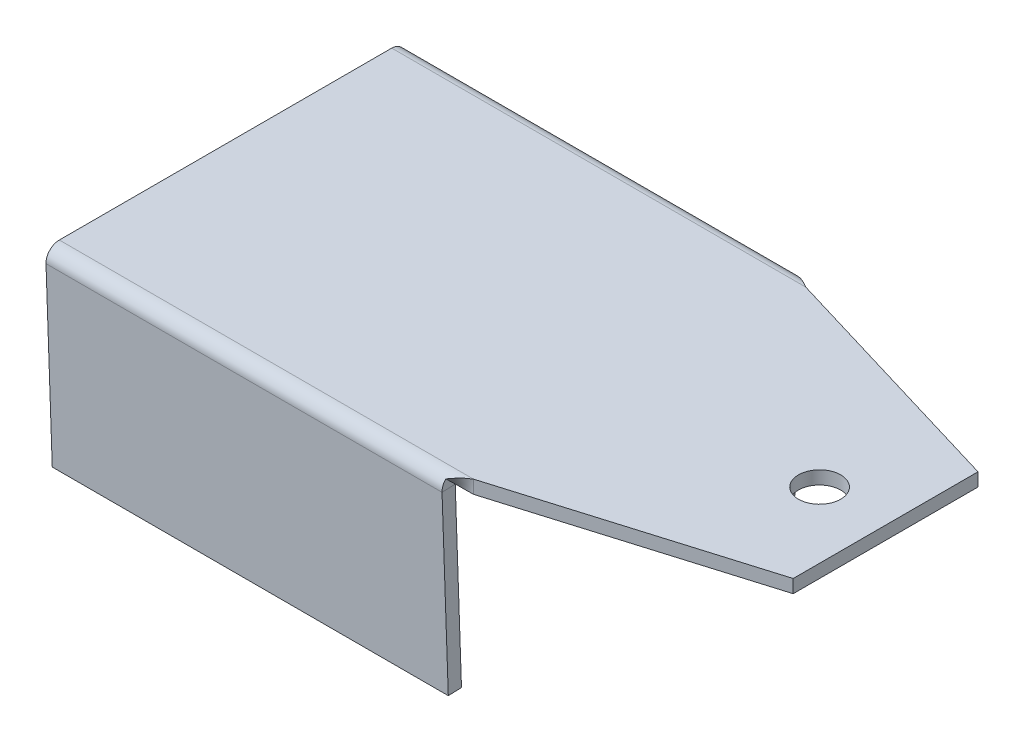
ISO-10303-21;
HEADER;
FILE_DESCRIPTION(('STEP AP214'),'2;1');
FILE_NAME('part.step','',(''),(''),'','','');
FILE_SCHEMA(('AUTOMOTIVE_DESIGN { 1 0 10303 214 1 1 1 1 }'));
ENDSEC;
DATA;
#1=APPLICATION_CONTEXT('core data for automotive mechanical design processes');
#2=APPLICATION_PROTOCOL_DEFINITION('international standard','automotive_design',2000,#1);
#3=PRODUCT_CONTEXT('',#1,'mechanical');
#4=PRODUCT('Part','Part','',(#3));
#5=PRODUCT_RELATED_PRODUCT_CATEGORY('part','',(#4));
#6=PRODUCT_DEFINITION_FORMATION('','',#4);
#7=PRODUCT_DEFINITION_CONTEXT('part definition',#1,'design');
#8=PRODUCT_DEFINITION('design','',#6,#7);
#9=PRODUCT_DEFINITION_SHAPE('','',#8);
#10=(LENGTH_UNIT() NAMED_UNIT(*) SI_UNIT(.MILLI.,.METRE.));
#11=(NAMED_UNIT(*) PLANE_ANGLE_UNIT() SI_UNIT($,.RADIAN.));
#12=(NAMED_UNIT(*) SI_UNIT($,.STERADIAN.) SOLID_ANGLE_UNIT());
#13=UNCERTAINTY_MEASURE_WITH_UNIT(LENGTH_MEASURE(1.E-05),#10,'distance_accuracy_value','');
#14=(GEOMETRIC_REPRESENTATION_CONTEXT(3) GLOBAL_UNCERTAINTY_ASSIGNED_CONTEXT((#13)) GLOBAL_UNIT_ASSIGNED_CONTEXT((#10,
#11,#12)) REPRESENTATION_CONTEXT('',''));
#15=CARTESIAN_POINT('',(0.,0.,0.));
#16=DIRECTION('',(0.,0.,1.));
#17=DIRECTION('',(1.,0.,0.));
#18=AXIS2_PLACEMENT_3D('',#15,#16,#17);
#19=CARTESIAN_POINT('',(0.,0.,-54.));
#20=DIRECTION('',(0.,-1.,0.));
#21=DIRECTION('',(0.,0.,-1.));
#22=AXIS2_PLACEMENT_3D('',#19,#20,#21);
#23=PLANE('',#22);
#24=CARTESIAN_POINT('',(45.,0.,-27.));
#25=DIRECTION('',(0.,1.,0.));
#26=DIRECTION('',(0.,0.,1.));
#27=AXIS2_PLACEMENT_3D('',#24,#25,#26);
#28=CIRCLE('',#27,1.6);
#29=CARTESIAN_POINT('',(45.,0.,-25.4));
#30=VERTEX_POINT('',#29);
#31=EDGE_CURVE('E401',#30,#30,#28,.T.);
#32=ORIENTED_EDGE('',*,*,#31,.T.);
#33=EDGE_LOOP('',(#32));
#34=FACE_BOUND('',#33,.T.);
#35=DIRECTION('',(0.957826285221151,0.,-0.287347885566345));
#36=VECTOR('',#35,1.);
#37=CARTESIAN_POINT('',(50.,0.,-20.));
#38=LINE('',#37,#36);
#39=CARTESIAN_POINT('',(31.3648474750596,0.,-14.4094542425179));
#40=VERTEX_POINT('',#39);
#41=CARTESIAN_POINT('',(50.,0.,-20.));
#42=VERTEX_POINT('',#41);
#43=EDGE_CURVE('E69',#40,#42,#38,.T.);
#44=ORIENTED_EDGE('',*,*,#43,.F.);
#45=DIRECTION('',(-1.,0.,0.));
#46=VECTOR('',#45,1.);
#47=CARTESIAN_POINT('',(0.,0.,-14.4094542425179));
#48=LINE('',#47,#46);
#49=CARTESIAN_POINT('',(0.,0.,-14.4094542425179));
#50=VERTEX_POINT('',#49);
#51=EDGE_CURVE('E62',#40,#50,#48,.T.);
#52=ORIENTED_EDGE('',*,*,#51,.T.);
#53=DIRECTION('',(0.,0.,1.));
#54=VECTOR('',#53,1.);
#55=CARTESIAN_POINT('',(0.,0.,0.));
#56=LINE('',#55,#54);
#57=CARTESIAN_POINT('',(0.,0.,-39.5905457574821));
#58=VERTEX_POINT('',#57);
#59=EDGE_CURVE('E77',#58,#50,#56,.T.);
#60=ORIENTED_EDGE('',*,*,#59,.F.);
#61=DIRECTION('',(-1.,0.,0.));
#62=VECTOR('',#61,1.);
#63=CARTESIAN_POINT('',(0.,0.,-39.5905457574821));
#64=LINE('',#63,#62);
#65=CARTESIAN_POINT('',(31.3648474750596,2.77131065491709E-08,-39.5905457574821));
#66=VERTEX_POINT('',#65);
#67=EDGE_CURVE('E430',#66,#58,#64,.T.);
#68=ORIENTED_EDGE('',*,*,#67,.F.);
#69=DIRECTION('',(-0.957826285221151,0.,-0.287347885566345));
#70=VECTOR('',#69,1.);
#71=CARTESIAN_POINT('',(30.,0.,-40.));
#72=LINE('',#71,#70);
#73=CARTESIAN_POINT('',(50.,0.,-34.));
#74=VERTEX_POINT('',#73);
#75=EDGE_CURVE('E415',#74,#66,#72,.T.);
#76=ORIENTED_EDGE('',*,*,#75,.F.);
#77=DIRECTION('',(0.,0.,-1.));
#78=VECTOR('',#77,1.);
#79=CARTESIAN_POINT('',(50.,0.,-20.));
#80=LINE('',#79,#78);
#81=EDGE_CURVE('E413',#42,#74,#80,.T.);
#82=ORIENTED_EDGE('',*,*,#81,.F.);
#83=EDGE_LOOP('',(#44,#52,#60,#68,#76,#82));
#84=FACE_BOUND('',#83,.T.);
#85=ADVANCED_FACE('F54',(#34,#84),#23,.T.);
#86=CARTESIAN_POINT('',(30.,1.,-40.));
#87=DIRECTION('',(-0.287347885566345,0.,0.957826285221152));
#88=DIRECTION('',(0.957826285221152,0.,0.287347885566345));
#89=AXIS2_PLACEMENT_3D('',#86,#87,#88);
#90=PLANE('',#89);
#91=ORIENTED_EDGE('',*,*,#75,.T.);
#92=CARTESIAN_POINT('',(31.3648474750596,1.00000002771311,-39.5905457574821));
#93=CARTESIAN_POINT('',(31.3648474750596,2.77131065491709E-08,-39.5905457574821));
#94=B_SPLINE_CURVE_WITH_KNOTS('',1,(#92,#93),.UNSPECIFIED.,.F.,.F.,(2,2),(0.,1.),.UNSPECIFIED.);
#95=CARTESIAN_POINT('',(31.3648474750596,1.00000002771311,-39.5905457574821));
#96=VERTEX_POINT('',#95);
#97=EDGE_CURVE('E396',#66,#96,#94,.F.);
#98=ORIENTED_EDGE('',*,*,#97,.T.);
#99=DIRECTION('',(-0.957826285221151,0.,-0.287347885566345));
#100=VECTOR('',#99,1.);
#101=CARTESIAN_POINT('',(30.,1.,-40.));
#102=LINE('',#101,#100);
#103=CARTESIAN_POINT('',(50.,1.,-34.));
#104=VERTEX_POINT('',#103);
#105=EDGE_CURVE('E418',#104,#96,#102,.T.);
#106=ORIENTED_EDGE('',*,*,#105,.F.);
#107=DIRECTION('',(0.,-1.,0.));
#108=VECTOR('',#107,1.);
#109=CARTESIAN_POINT('',(50.,1.,-34.));
#110=LINE('',#109,#108);
#111=EDGE_CURVE('E420',#104,#74,#110,.T.);
#112=ORIENTED_EDGE('',*,*,#111,.T.);
#113=EDGE_LOOP('',(#91,#98,#106,#112));
#114=FACE_BOUND('',#113,.T.);
#115=ADVANCED_FACE('F448',(#114),#90,.F.);
#116=CARTESIAN_POINT('',(0.,1.,0.));
#117=DIRECTION('',(1.,0.,0.));
#118=DIRECTION('',(0.,0.,-1.));
#119=AXIS2_PLACEMENT_3D('',#116,#117,#118);
#120=PLANE('',#119);
#121=DIRECTION('',(0.,-1.,0.));
#122=VECTOR('',#121,1.);
#123=CARTESIAN_POINT('',(0.,0.999999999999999,-14.4094542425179));
#124=LINE('',#123,#122);
#125=CARTESIAN_POINT('',(0.,1.,-14.4094542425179));
#126=VERTEX_POINT('',#125);
#127=EDGE_CURVE('E478',#126,#50,#124,.T.);
#128=ORIENTED_EDGE('',*,*,#127,.F.);
#129=DIRECTION('',(0.,0.,1.));
#130=VECTOR('',#129,1.);
#131=CARTESIAN_POINT('',(0.,1.,0.));
#132=LINE('',#131,#130);
#133=CARTESIAN_POINT('',(0.,1.00000001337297,-39.5905457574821));
#134=VERTEX_POINT('',#133);
#135=EDGE_CURVE('E485',#134,#126,#132,.T.);
#136=ORIENTED_EDGE('',*,*,#135,.F.);
#137=DIRECTION('',(0.,-1.,0.));
#138=VECTOR('',#137,1.);
#139=CARTESIAN_POINT('',(0.,0.999999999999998,-39.5905457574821));
#140=LINE('',#139,#138);
#141=EDGE_CURVE('E427',#134,#58,#140,.T.);
#142=ORIENTED_EDGE('',*,*,#141,.T.);
#143=ORIENTED_EDGE('',*,*,#59,.T.);
#144=EDGE_LOOP('',(#128,#136,#142,#143));
#145=FACE_BOUND('',#144,.T.);
#146=ADVANCED_FACE('F458',(#145),#120,.F.);
#147=CARTESIAN_POINT('',(0.,1.,-54.));
#148=DIRECTION('',(0.,-1.,0.));
#149=DIRECTION('',(0.,0.,-1.));
#150=AXIS2_PLACEMENT_3D('',#147,#148,#149);
#151=PLANE('',#150);
#152=DIRECTION('',(-1.,0.,0.));
#153=VECTOR('',#152,1.);
#154=CARTESIAN_POINT('',(0.,1.,-14.4094542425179));
#155=LINE('',#154,#153);
#156=CARTESIAN_POINT('',(31.3648474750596,0.999999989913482,-14.4094542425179));
#157=VERTEX_POINT('',#156);
#158=EDGE_CURVE('E429',#157,#126,#155,.T.);
#159=ORIENTED_EDGE('',*,*,#158,.F.);
#160=DIRECTION('',(0.957826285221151,0.,-0.287347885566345));
#161=VECTOR('',#160,1.);
#162=CARTESIAN_POINT('',(50.,1.,-20.));
#163=LINE('',#162,#161);
#164=CARTESIAN_POINT('',(50.,1.,-20.));
#165=VERTEX_POINT('',#164);
#166=EDGE_CURVE('E419',#157,#165,#163,.T.);
#167=ORIENTED_EDGE('',*,*,#166,.T.);
#168=DIRECTION('',(0.,0.,-1.));
#169=VECTOR('',#168,1.);
#170=CARTESIAN_POINT('',(50.,1.,-20.));
#171=LINE('',#170,#169);
#172=EDGE_CURVE('E416',#165,#104,#171,.T.);
#173=ORIENTED_EDGE('',*,*,#172,.T.);
#174=ORIENTED_EDGE('',*,*,#105,.T.);
#175=DIRECTION('',(-1.,0.,0.));
#176=VECTOR('',#175,1.);
#177=CARTESIAN_POINT('',(0.,1.,-39.5905457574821));
#178=LINE('',#177,#176);
#179=EDGE_CURVE('E426',#96,#134,#178,.T.);
#180=ORIENTED_EDGE('',*,*,#179,.T.);
#181=ORIENTED_EDGE('',*,*,#135,.T.);
#182=EDGE_LOOP('',(#159,#167,#173,#174,#180,#181));
#183=FACE_BOUND('',#182,.T.);
#184=CARTESIAN_POINT('',(45.,1.,-27.));
#185=DIRECTION('',(0.,1.,0.));
#186=DIRECTION('',(0.,0.,1.));
#187=AXIS2_PLACEMENT_3D('',#184,#185,#186);
#188=CIRCLE('',#187,1.6);
#189=CARTESIAN_POINT('',(45.,1.,-25.4));
#190=VERTEX_POINT('',#189);
#191=EDGE_CURVE('E409',#190,#190,#188,.T.);
#192=ORIENTED_EDGE('',*,*,#191,.F.);
#193=EDGE_LOOP('',(#192));
#194=FACE_BOUND('',#193,.T.);
#195=ADVANCED_FACE('F464',(#183,#194),#151,.F.);
#196=CARTESIAN_POINT('',(50.,1.,-20.));
#197=DIRECTION('',(-0.287347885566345,0.,-0.957826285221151));
#198=DIRECTION('',(-0.957826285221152,0.,0.287347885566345));
#199=AXIS2_PLACEMENT_3D('',#196,#197,#198);
#200=PLANE('',#199);
#201=CARTESIAN_POINT('',(31.3648474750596,-1.00865177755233E-08,-14.4094542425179));
#202=CARTESIAN_POINT('',(31.3648474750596,0.999999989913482,-14.4094542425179));
#203=B_SPLINE_CURVE_WITH_KNOTS('',1,(#201,#202),.UNSPECIFIED.,.F.,.F.,(2,2),(0.,1.),.UNSPECIFIED.);
#204=EDGE_CURVE('E12',#40,#157,#203,.T.);
#205=ORIENTED_EDGE('',*,*,#204,.F.);
#206=ORIENTED_EDGE('',*,*,#43,.T.);
#207=DIRECTION('',(0.,-1.,0.));
#208=VECTOR('',#207,1.);
#209=CARTESIAN_POINT('',(50.,1.,-20.));
#210=LINE('',#209,#208);
#211=EDGE_CURVE('E423',#165,#42,#210,.T.);
#212=ORIENTED_EDGE('',*,*,#211,.F.);
#213=ORIENTED_EDGE('',*,*,#166,.F.);
#214=EDGE_LOOP('',(#205,#206,#212,#213));
#215=FACE_BOUND('',#214,.T.);
#216=ADVANCED_FACE('F460',(#215),#200,.F.);
#217=CARTESIAN_POINT('',(50.,1.,-20.));
#218=DIRECTION('',(-1.,0.,0.));
#219=DIRECTION('',(0.,0.,1.));
#220=AXIS2_PLACEMENT_3D('',#217,#218,#219);
#221=PLANE('',#220);
#222=ORIENTED_EDGE('',*,*,#81,.T.);
#223=ORIENTED_EDGE('',*,*,#111,.F.);
#224=ORIENTED_EDGE('',*,*,#172,.F.);
#225=ORIENTED_EDGE('',*,*,#211,.T.);
#226=EDGE_LOOP('',(#222,#223,#224,#225));
#227=FACE_BOUND('',#226,.T.);
#228=ADVANCED_FACE('F459',(#227),#221,.F.);
#229=CARTESIAN_POINT('',(45.,1.,-27.));
#230=DIRECTION('',(0.,-1.,0.));
#231=DIRECTION('',(0.,0.,-1.));
#232=AXIS2_PLACEMENT_3D('',#229,#230,#231);
#233=CYLINDRICAL_SURFACE('',#232,1.6);
#234=ORIENTED_EDGE('',*,*,#191,.T.);
#235=EDGE_LOOP('',(#234));
#236=FACE_BOUND('',#235,.T.);
#237=ORIENTED_EDGE('',*,*,#31,.F.);
#238=EDGE_LOOP('',(#237));
#239=FACE_BOUND('',#238,.T.);
#240=ADVANCED_FACE('F374',(#236,#239),#233,.F.);
#241=CARTESIAN_POINT('',(30.,-0.0100000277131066,-39.5905457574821));
#242=DIRECTION('',(1.,0.,0.));
#243=DIRECTION('',(0.,0.,-1.));
#244=AXIS2_PLACEMENT_3D('',#241,#242,#243);
#245=PLANE('',#244);
#246=CARTESIAN_POINT('',(30.,-0.00305339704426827,-39.5977391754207));
#247=CARTESIAN_POINT('',(30.,0.691604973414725,-40.3170789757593));
#248=B_SPLINE_CURVE_WITH_KNOTS('',1,(#246,#247),.UNSPECIFIED.,.F.,.F.,(2,2),(0.,1.),.UNSPECIFIED.);
#249=CARTESIAN_POINT('',(30.,-0.00305339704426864,-39.5977391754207));
#250=VERTEX_POINT('',#249);
#251=CARTESIAN_POINT('',(30.,0.691604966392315,-40.3170789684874));
#252=VERTEX_POINT('',#251);
#253=EDGE_CURVE('E410',#250,#252,#248,.T.);
#254=ORIENTED_EDGE('',*,*,#253,.F.);
#255=CARTESIAN_POINT('',(30.,-0.01,-39.5905457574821));
#256=DIRECTION('',(-1.,0.,0.));
#257=DIRECTION('',(0.,0.,1.));
#258=AXIS2_PLACEMENT_3D('',#255,#256,#257);
#259=CIRCLE('',#258,0.0100000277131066);
#260=CARTESIAN_POINT('',(30.,-0.0103489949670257,-39.6005396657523));
#261=VERTEX_POINT('',#260);
#262=EDGE_CURVE('E299',#250,#261,#259,.T.);
#263=ORIENTED_EDGE('',*,*,#262,.T.);
#264=DIRECTION('',(0.,-0.0348994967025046,-0.999390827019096));
#265=VECTOR('',#264,1.);
#266=CARTESIAN_POINT('',(30.,-0.0452484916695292,-40.5999304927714));
#267=LINE('',#266,#265);
#268=CARTESIAN_POINT('',(30.,-0.0452484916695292,-40.5999304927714));
#269=VERTEX_POINT('',#268);
#270=EDGE_CURVE('E320',#261,#269,#267,.T.);
#271=ORIENTED_EDGE('',*,*,#270,.T.);
#272=CARTESIAN_POINT('',(30.,-0.0100000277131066,-39.5905457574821));
#273=DIRECTION('',(-1.,0.,0.));
#274=DIRECTION('',(0.,0.,1.));
#275=AXIS2_PLACEMENT_3D('',#272,#273,#274);
#276=CIRCLE('',#275,1.01000003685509);
#277=EDGE_CURVE('E336',#252,#269,#276,.T.);
#278=ORIENTED_EDGE('',*,*,#277,.F.);
#279=EDGE_LOOP('',(#254,#263,#271,#278));
#280=FACE_BOUND('',#279,.T.);
#281=ADVANCED_FACE('F369',(#280),#245,.T.);
#282=CARTESIAN_POINT('',(0.,-0.0100000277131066,-39.5905457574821));
#283=DIRECTION('',(-1.,0.,0.));
#284=DIRECTION('',(0.,0.,1.));
#285=AXIS2_PLACEMENT_3D('',#282,#283,#284);
#286=PLANE('',#285);
#287=DIRECTION('',(0.,0.0348994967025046,0.999390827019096));
#288=VECTOR('',#287,1.);
#289=CARTESIAN_POINT('',(0.,-0.0452484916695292,-40.5999304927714));
#290=LINE('',#289,#288);
#291=CARTESIAN_POINT('',(0.,-0.0452484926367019,-40.5999305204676));
#292=VERTEX_POINT('',#291);
#293=CARTESIAN_POINT('',(0.,-0.0103489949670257,-39.6005396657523));
#294=VERTEX_POINT('',#293);
#295=EDGE_CURVE('E323',#292,#294,#290,.T.);
#296=ORIENTED_EDGE('',*,*,#295,.T.);
#297=CARTESIAN_POINT('',(0.,-0.01,-39.5905457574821));
#298=DIRECTION('',(-1.,0.,0.));
#299=DIRECTION('',(0.,0.,1.));
#300=AXIS2_PLACEMENT_3D('',#297,#298,#299);
#301=CIRCLE('',#300,0.0100000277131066);
#302=EDGE_CURVE('E329',#294,#58,#301,.F.);
#303=ORIENTED_EDGE('',*,*,#302,.T.);
#304=ORIENTED_EDGE('',*,*,#141,.F.);
#305=CARTESIAN_POINT('',(0.,-0.0100000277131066,-39.5905457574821));
#306=DIRECTION('',(1.,0.,0.));
#307=DIRECTION('',(0.,0.,-1.));
#308=AXIS2_PLACEMENT_3D('',#305,#306,#307);
#309=CIRCLE('',#308,1.01000004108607);
#310=EDGE_CURVE('E332',#292,#134,#309,.T.);
#311=ORIENTED_EDGE('',*,*,#310,.F.);
#312=EDGE_LOOP('',(#296,#303,#304,#311));
#313=FACE_BOUND('',#312,.T.);
#314=ADVANCED_FACE('F364',(#313),#286,.T.);
#315=CARTESIAN_POINT('',(31.3648474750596,1.00000002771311,-39.5905457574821));
#316=CARTESIAN_POINT('',(31.1373612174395,1.00000002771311,-39.725699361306));
#317=CARTESIAN_POINT('',(30.9098983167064,0.972515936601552,-39.860781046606));
#318=CARTESIAN_POINT('',(30.4549491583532,0.866903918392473,-40.1095873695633));
#319=CARTESIAN_POINT('',(30.2274862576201,0.788826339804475,-40.2231933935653));
#320=CARTESIAN_POINT('',(30.,0.691604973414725,-40.3170789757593));
#321=CARTESIAN_POINT('',(31.3648474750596,2.77131065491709E-08,-39.5905457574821));
#322=CARTESIAN_POINT('',(31.1373728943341,2.77131065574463E-08,-39.5918838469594));
#323=CARTESIAN_POINT('',(30.9098983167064,-0.000272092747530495,-39.5932213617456));
#324=CARTESIAN_POINT('',(30.4549491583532,-0.00131775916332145,-39.5956847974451));
#325=CARTESIAN_POINT('',(30.2274745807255,-0.00209085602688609,-39.5968096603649));
#326=CARTESIAN_POINT('',(30.,-0.00305339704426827,-39.5977391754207));
#327=B_SPLINE_SURFACE_WITH_KNOTS('',1,3,((#315,#316,#317,#318,#319,#320),(#321,#322,#323,#324,
#325,#326)),.UNSPECIFIED.,.F.,.F.,.F.,(2,2),(4,2,4),(0.,1.),(0.,0.5,1.),.UNSPECIFIED.);
#328=CARTESIAN_POINT('',(31.3648474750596,2.77131065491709E-08,-39.5905457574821));
#329=CARTESIAN_POINT('',(31.1373728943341,2.77131065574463E-08,-39.5918838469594));
#330=CARTESIAN_POINT('',(30.9098983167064,-0.000272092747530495,-39.5932213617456));
#331=CARTESIAN_POINT('',(30.4549491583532,-0.00131775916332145,-39.5956847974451));
#332=CARTESIAN_POINT('',(30.2274745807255,-0.00209085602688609,-39.5968096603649));
#333=CARTESIAN_POINT('',(30.,-0.00305339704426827,-39.5977391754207));
#334=B_SPLINE_CURVE_WITH_KNOTS('',3,(#328,#329,#330,#331,#332,#333),.UNSPECIFIED.,.F.,.F.,(4,2,
4),(0.,0.5,1.),.UNSPECIFIED.);
#335=EDGE_CURVE('E331',#66,#250,#334,.T.);
#336=CARTESIAN_POINT('',(30.,0.691604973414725,-40.3170789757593));
#337=CARTESIAN_POINT('',(30.2274862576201,0.788826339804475,-40.2231933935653));
#338=CARTESIAN_POINT('',(30.4549491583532,0.866903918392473,-40.1095873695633));
#339=CARTESIAN_POINT('',(30.9098983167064,0.972515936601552,-39.860781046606));
#340=CARTESIAN_POINT('',(31.1373612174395,1.00000002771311,-39.725699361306));
#341=CARTESIAN_POINT('',(31.3648474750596,1.00000002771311,-39.5905457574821));
#342=B_SPLINE_CURVE_WITH_KNOTS('',3,(#336,#337,#338,#339,#340,#341),.UNSPECIFIED.,.F.,.F.,(4,2,
4),(0.,0.5,1.),.UNSPECIFIED.);
#343=EDGE_CURVE('E335',#96,#252,#342,.F.);
#344=ORIENTED_EDGE('',*,*,#335,.T.);
#345=ORIENTED_EDGE('',*,*,#253,.T.);
#346=ORIENTED_EDGE('',*,*,#343,.F.);
#347=ORIENTED_EDGE('',*,*,#97,.F.);
#348=EDGE_LOOP('',(#344,#345,#346,#347));
#349=FACE_BOUND('',#348,.T.);
#350=ADVANCED_FACE('F362',(#349),#327,.T.);
#351=CARTESIAN_POINT('',(47.0738918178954,-0.01,-39.5905457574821));
#352=DIRECTION('',(-1.,0.,0.));
#353=DIRECTION('',(0.,0.,1.));
#354=AXIS2_PLACEMENT_3D('',#351,#352,#353);
#355=CYLINDRICAL_SURFACE('',#354,1.01000002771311);
#356=ORIENTED_EDGE('',*,*,#179,.F.);
#357=ORIENTED_EDGE('',*,*,#343,.T.);
#358=ORIENTED_EDGE('',*,*,#277,.T.);
#359=DIRECTION('',(-1.,0.,0.));
#360=VECTOR('',#359,1.);
#361=CARTESIAN_POINT('',(0.,-0.0452484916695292,-40.5999304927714));
#362=LINE('',#361,#360);
#363=EDGE_CURVE('E326',#269,#292,#362,.T.);
#364=ORIENTED_EDGE('',*,*,#363,.T.);
#365=ORIENTED_EDGE('',*,*,#310,.T.);
#366=EDGE_LOOP('',(#356,#357,#358,#364,#365));
#367=FACE_BOUND('',#366,.T.);
#368=ADVANCED_FACE('F351',(#367),#355,.T.);
#369=CARTESIAN_POINT('',(47.0738918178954,-0.01,-39.5905457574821));
#370=DIRECTION('',(-1.,0.,0.));
#371=DIRECTION('',(0.,0.,1.));
#372=AXIS2_PLACEMENT_3D('',#369,#370,#371);
#373=CYLINDRICAL_SURFACE('',#372,0.0100000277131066);
#374=ORIENTED_EDGE('',*,*,#67,.T.);
#375=ORIENTED_EDGE('',*,*,#302,.F.);
#376=DIRECTION('',(-1.,0.,0.));
#377=VECTOR('',#376,1.);
#378=CARTESIAN_POINT('',(0.,-0.0103489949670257,-39.6005396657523));
#379=LINE('',#378,#377);
#380=EDGE_CURVE('E303',#261,#294,#379,.T.);
#381=ORIENTED_EDGE('',*,*,#380,.F.);
#382=ORIENTED_EDGE('',*,*,#262,.F.);
#383=ORIENTED_EDGE('',*,*,#335,.F.);
#384=EDGE_LOOP('',(#374,#375,#381,#382,#383));
#385=FACE_BOUND('',#384,.T.);
#386=ADVANCED_FACE('F361',(#385),#373,.F.);
#387=CARTESIAN_POINT('',(0.,-13.6275152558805,-40.1256272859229));
#388=DIRECTION('',(0.,0.999390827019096,-0.0348994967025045));
#389=DIRECTION('',(1.,0.,0.));
#390=AXIS2_PLACEMENT_3D('',#387,#388,#389);
#391=PLANE('',#390);
#392=DIRECTION('',(-1.,0.,0.));
#393=VECTOR('',#392,1.);
#394=CARTESIAN_POINT('',(0.,-13.592615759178,-39.1262364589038));
#395=LINE('',#394,#393);
#396=CARTESIAN_POINT('',(30.,-13.592615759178,-39.1262364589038));
#397=VERTEX_POINT('',#396);
#398=CARTESIAN_POINT('',(0.,-13.592615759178,-39.1262364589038));
#399=VERTEX_POINT('',#398);
#400=EDGE_CURVE('E318',#397,#399,#395,.T.);
#401=ORIENTED_EDGE('',*,*,#400,.T.);
#402=DIRECTION('',(0.,0.0348994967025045,0.999390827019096));
#403=VECTOR('',#402,1.);
#404=CARTESIAN_POINT('',(0.,-13.6275152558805,-40.1256272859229));
#405=LINE('',#404,#403);
#406=CARTESIAN_POINT('',(0.,-13.6275152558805,-40.1256272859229));
#407=VERTEX_POINT('',#406);
#408=EDGE_CURVE('E300',#407,#399,#405,.T.);
#409=ORIENTED_EDGE('',*,*,#408,.F.);
#410=DIRECTION('',(-1.,0.,0.));
#411=VECTOR('',#410,1.);
#412=CARTESIAN_POINT('',(0.,-13.6275152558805,-40.1256272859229));
#413=LINE('',#412,#411);
#414=CARTESIAN_POINT('',(30.,-13.6275152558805,-40.1256272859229));
#415=VERTEX_POINT('',#414);
#416=EDGE_CURVE('E311',#415,#407,#413,.T.);
#417=ORIENTED_EDGE('',*,*,#416,.F.);
#418=DIRECTION('',(0.,0.0348994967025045,0.999390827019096));
#419=VECTOR('',#418,1.);
#420=CARTESIAN_POINT('',(30.,-13.6275152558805,-40.1256272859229));
#421=LINE('',#420,#419);
#422=EDGE_CURVE('E315',#415,#397,#421,.T.);
#423=ORIENTED_EDGE('',*,*,#422,.T.);
#424=EDGE_LOOP('',(#401,#409,#417,#423));
#425=FACE_BOUND('',#424,.T.);
#426=ADVANCED_FACE('F593',(#425),#391,.F.);
#427=CARTESIAN_POINT('',(0.,-13.6275152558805,-40.1256272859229));
#428=DIRECTION('',(0.,0.0348994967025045,0.999390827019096));
#429=DIRECTION('',(0.,-0.999390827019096,0.0348994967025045));
#430=AXIS2_PLACEMENT_3D('',#427,#428,#429);
#431=PLANE('',#430);
#432=ORIENTED_EDGE('',*,*,#363,.F.);
#433=DIRECTION('',(0.,-0.999390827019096,0.0348994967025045));
#434=VECTOR('',#433,1.);
#435=CARTESIAN_POINT('',(30.,0.36395632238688,-40.614220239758));
#436=LINE('',#435,#434);
#437=EDGE_CURVE('E313',#269,#415,#436,.T.);
#438=ORIENTED_EDGE('',*,*,#437,.T.);
#439=ORIENTED_EDGE('',*,*,#416,.T.);
#440=DIRECTION('',(0.,0.999390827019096,-0.0348994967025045));
#441=VECTOR('',#440,1.);
#442=CARTESIAN_POINT('',(0.,40.3395894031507,-42.0102001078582));
#443=LINE('',#442,#441);
#444=EDGE_CURVE('E308',#407,#292,#443,.T.);
#445=ORIENTED_EDGE('',*,*,#444,.T.);
#446=EDGE_LOOP('',(#432,#438,#439,#445));
#447=FACE_BOUND('',#446,.T.);
#448=ADVANCED_FACE('F589',(#447),#431,.F.);
#449=CARTESIAN_POINT('',(30.,0.36395632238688,-40.614220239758));
#450=DIRECTION('',(-1.,0.,0.));
#451=DIRECTION('',(0.,0.999390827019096,-0.0348994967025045));
#452=AXIS2_PLACEMENT_3D('',#449,#450,#451);
#453=PLANE('',#452);
#454=ORIENTED_EDGE('',*,*,#270,.F.);
#455=DIRECTION('',(0.,-0.999390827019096,0.0348994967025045));
#456=VECTOR('',#455,1.);
#457=CARTESIAN_POINT('',(30.,0.398855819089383,-39.6148294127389));
#458=LINE('',#457,#456);
#459=EDGE_CURVE('E306',#261,#397,#458,.T.);
#460=ORIENTED_EDGE('',*,*,#459,.T.);
#461=ORIENTED_EDGE('',*,*,#422,.F.);
#462=ORIENTED_EDGE('',*,*,#437,.F.);
#463=EDGE_LOOP('',(#454,#460,#461,#462));
#464=FACE_BOUND('',#463,.T.);
#465=ADVANCED_FACE('F587',(#464),#453,.F.);
#466=CARTESIAN_POINT('',(0.,-13.592615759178,-39.1262364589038));
#467=DIRECTION('',(0.,0.0348994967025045,0.999390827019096));
#468=DIRECTION('',(0.,-0.999390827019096,0.0348994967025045));
#469=AXIS2_PLACEMENT_3D('',#466,#467,#468);
#470=PLANE('',#469);
#471=ORIENTED_EDGE('',*,*,#459,.F.);
#472=ORIENTED_EDGE('',*,*,#380,.T.);
#473=DIRECTION('',(0.,0.999390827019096,-0.0348994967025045));
#474=VECTOR('',#473,1.);
#475=CARTESIAN_POINT('',(0.,40.3744888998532,-41.0108092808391));
#476=LINE('',#475,#474);
#477=EDGE_CURVE('E292',#399,#294,#476,.T.);
#478=ORIENTED_EDGE('',*,*,#477,.F.);
#479=ORIENTED_EDGE('',*,*,#400,.F.);
#480=EDGE_LOOP('',(#471,#472,#478,#479));
#481=FACE_BOUND('',#480,.T.);
#482=ADVANCED_FACE('F583',(#481),#470,.T.);
#483=CARTESIAN_POINT('',(0.,40.3395894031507,-42.0102001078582));
#484=DIRECTION('',(1.,0.,0.));
#485=DIRECTION('',(0.,-0.999390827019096,0.0348994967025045));
#486=AXIS2_PLACEMENT_3D('',#483,#484,#485);
#487=PLANE('',#486);
#488=ORIENTED_EDGE('',*,*,#295,.F.);
#489=ORIENTED_EDGE('',*,*,#444,.F.);
#490=ORIENTED_EDGE('',*,*,#408,.T.);
#491=ORIENTED_EDGE('',*,*,#477,.T.);
#492=EDGE_LOOP('',(#488,#489,#490,#491));
#493=FACE_BOUND('',#492,.T.);
#494=ADVANCED_FACE('F242',(#493),#487,.F.);
#495=CARTESIAN_POINT('',(30.,0.691604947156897,-13.6829210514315));
#496=CARTESIAN_POINT('',(30.2274862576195,0.788826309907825,-13.7768066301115));
#497=CARTESIAN_POINT('',(30.4549491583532,0.866903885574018,-13.890412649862));
#498=CARTESIAN_POINT('',(30.9098983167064,0.972515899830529,-14.1392189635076));
#499=CARTESIAN_POINT('',(31.1373612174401,0.999999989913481,-14.2743006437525));
#500=CARTESIAN_POINT('',(31.3648474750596,0.999999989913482,-14.4094542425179));
#501=CARTESIAN_POINT('',(30.,-0.00305342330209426,-14.4022608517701));
#502=CARTESIAN_POINT('',(30.2274745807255,-0.00209088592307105,-14.4031903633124));
#503=CARTESIAN_POINT('',(30.4549491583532,-0.00131779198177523,-14.4043152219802));
#504=CARTESIAN_POINT('',(30.9098983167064,-0.000272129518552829,-14.406778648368));
#505=CARTESIAN_POINT('',(31.1373728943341,-1.00865177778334E-08,-14.4081161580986));
#506=CARTESIAN_POINT('',(31.3648474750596,-1.00865177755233E-08,-14.4094542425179));
#507=B_SPLINE_SURFACE_WITH_KNOTS('',1,3,((#495,#496,#497,#498,#499,#500),(#501,#502,#503,#504,
#505,#506)),.UNSPECIFIED.,.F.,.F.,.F.,(2,2),(4,2,4),(0.,1.),(0.,0.5,1.),.UNSPECIFIED.);
#508=CARTESIAN_POINT('',(30.,0.691604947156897,-13.6829210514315));
#509=CARTESIAN_POINT('',(30.,-0.00305342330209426,-14.4022608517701));
#510=B_SPLINE_CURVE_WITH_KNOTS('',1,(#508,#509),.UNSPECIFIED.,.F.,.F.,(2,2),(0.,1.),.UNSPECIFIED.);
#511=CARTESIAN_POINT('',(30.,-0.0030534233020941,-14.4022608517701));
#512=VERTEX_POINT('',#511);
#513=CARTESIAN_POINT('',(30.,0.691604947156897,-13.6829210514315));
#514=VERTEX_POINT('',#513);
#515=EDGE_CURVE('E277',#512,#514,#510,.F.);
#516=CARTESIAN_POINT('',(30.,-0.00305342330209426,-14.4022608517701));
#517=CARTESIAN_POINT('',(30.2274745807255,-0.00209088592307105,-14.4031903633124));
#518=CARTESIAN_POINT('',(30.4549491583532,-0.00131779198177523,-14.4043152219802));
#519=CARTESIAN_POINT('',(30.9098983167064,-0.000272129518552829,-14.406778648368));
#520=CARTESIAN_POINT('',(31.1373728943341,-1.00865177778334E-08,-14.4081161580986));
#521=CARTESIAN_POINT('',(31.3648474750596,-1.00865177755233E-08,-14.4094542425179));
#522=B_SPLINE_CURVE_WITH_KNOTS('',3,(#516,#517,#518,#519,#520,#521),.UNSPECIFIED.,.F.,.F.,(4,2,
4),(0.,0.5,1.),.UNSPECIFIED.);
#523=EDGE_CURVE('E205',#512,#40,#522,.T.);
#524=CARTESIAN_POINT('',(31.3648474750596,0.999999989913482,-14.4094542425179));
#525=CARTESIAN_POINT('',(31.1373612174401,0.999999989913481,-14.2743006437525));
#526=CARTESIAN_POINT('',(30.9098983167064,0.972515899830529,-14.1392189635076));
#527=CARTESIAN_POINT('',(30.4549491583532,0.866903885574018,-13.890412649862));
#528=CARTESIAN_POINT('',(30.2274862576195,0.788826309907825,-13.7768066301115));
#529=CARTESIAN_POINT('',(30.,0.691604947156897,-13.6829210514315));
#530=B_SPLINE_CURVE_WITH_KNOTS('',3,(#524,#525,#526,#527,#528,#529),.UNSPECIFIED.,.F.,.F.,(4,2,
4),(0.,0.5,1.),.UNSPECIFIED.);
#531=EDGE_CURVE('E210',#514,#157,#530,.F.);
#532=ORIENTED_EDGE('',*,*,#515,.F.);
#533=ORIENTED_EDGE('',*,*,#523,.T.);
#534=ORIENTED_EDGE('',*,*,#204,.T.);
#535=ORIENTED_EDGE('',*,*,#531,.F.);
#536=EDGE_LOOP('',(#532,#533,#534,#535));
#537=FACE_BOUND('',#536,.T.);
#538=ADVANCED_FACE('F235',(#537),#507,.T.);
#539=CARTESIAN_POINT('',(0.,-0.00999998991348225,-14.4094542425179));
#540=DIRECTION('',(-1.,0.,0.));
#541=DIRECTION('',(0.,0.,1.));
#542=AXIS2_PLACEMENT_3D('',#539,#540,#541);
#543=PLANE('',#542);
#544=ORIENTED_EDGE('',*,*,#127,.T.);
#545=CARTESIAN_POINT('',(0.,-0.01,-14.4094542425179));
#546=DIRECTION('',(1.,0.,0.));
#547=DIRECTION('',(0.,0.,-1.));
#548=AXIS2_PLACEMENT_3D('',#545,#546,#547);
#549=CIRCLE('',#548,0.00999998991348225);
#550=CARTESIAN_POINT('',(0.,-0.0103489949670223,-14.3994603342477));
#551=VERTEX_POINT('',#550);
#552=EDGE_CURVE('E201',#50,#551,#549,.T.);
#553=ORIENTED_EDGE('',*,*,#552,.T.);
#554=DIRECTION('',(0.,0.0348994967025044,-0.999390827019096));
#555=VECTOR('',#554,1.);
#556=CARTESIAN_POINT('',(0.,-0.0452484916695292,-13.4000695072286));
#557=LINE('',#556,#555);
#558=CARTESIAN_POINT('',(0.,-0.0452484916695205,-13.4000695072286));
#559=VERTEX_POINT('',#558);
#560=EDGE_CURVE('E176',#559,#551,#557,.T.);
#561=ORIENTED_EDGE('',*,*,#560,.F.);
#562=CARTESIAN_POINT('',(0.,-0.00999998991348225,-14.4094542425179));
#563=DIRECTION('',(1.,0.,0.));
#564=DIRECTION('',(0.,0.,-1.));
#565=AXIS2_PLACEMENT_3D('',#562,#563,#564);
#566=CIRCLE('',#565,1.00999998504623);
#567=EDGE_CURVE('E206',#126,#559,#566,.T.);
#568=ORIENTED_EDGE('',*,*,#567,.F.);
#569=EDGE_LOOP('',(#544,#553,#561,#568));
#570=FACE_BOUND('',#569,.T.);
#571=ADVANCED_FACE('F230',(#570),#543,.T.);
#572=CARTESIAN_POINT('',(30.,-0.00999998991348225,-14.4094542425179));
#573=DIRECTION('',(1.,0.,0.));
#574=DIRECTION('',(0.,0.,-1.));
#575=AXIS2_PLACEMENT_3D('',#572,#573,#574);
#576=PLANE('',#575);
#577=CARTESIAN_POINT('',(30.,-0.01,-14.4094542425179));
#578=DIRECTION('',(1.,0.,0.));
#579=DIRECTION('',(0.,0.,-1.));
#580=AXIS2_PLACEMENT_3D('',#577,#578,#579);
#581=CIRCLE('',#580,0.00999998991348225);
#582=CARTESIAN_POINT('',(30.,-0.010348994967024,-14.3994603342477));
#583=VERTEX_POINT('',#582);
#584=EDGE_CURVE('E204',#583,#512,#581,.F.);
#585=ORIENTED_EDGE('',*,*,#584,.T.);
#586=ORIENTED_EDGE('',*,*,#515,.T.);
#587=CARTESIAN_POINT('',(30.,-0.00999998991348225,-14.4094542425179));
#588=DIRECTION('',(-1.,0.,0.));
#589=DIRECTION('',(0.,0.,1.));
#590=AXIS2_PLACEMENT_3D('',#587,#588,#589);
#591=CIRCLE('',#590,1.00999998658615);
#592=CARTESIAN_POINT('',(30.,-0.0452484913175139,-13.400069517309));
#593=VERTEX_POINT('',#592);
#594=EDGE_CURVE('E209',#593,#514,#591,.T.);
#595=ORIENTED_EDGE('',*,*,#594,.F.);
#596=DIRECTION('',(0.,-0.0348994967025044,0.999390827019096));
#597=VECTOR('',#596,1.);
#598=CARTESIAN_POINT('',(30.,-0.0452484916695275,-13.4000695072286));
#599=LINE('',#598,#597);
#600=EDGE_CURVE('E501',#583,#593,#599,.T.);
#601=ORIENTED_EDGE('',*,*,#600,.F.);
#602=EDGE_LOOP('',(#585,#586,#595,#601));
#603=FACE_BOUND('',#602,.T.);
#604=ADVANCED_FACE('F228',(#603),#576,.T.);
#605=CARTESIAN_POINT('',(-15.7090443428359,-0.01,-14.4094542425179));
#606=DIRECTION('',(1.,0.,0.));
#607=DIRECTION('',(0.,0.,-1.));
#608=AXIS2_PLACEMENT_3D('',#605,#606,#607);
#609=CYLINDRICAL_SURFACE('',#608,1.00999998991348);
#610=DIRECTION('',(-1.,0.,0.));
#611=VECTOR('',#610,1.);
#612=CARTESIAN_POINT('',(0.,-0.0452484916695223,-13.4000695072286));
#613=LINE('',#612,#611);
#614=EDGE_CURVE('E196',#593,#559,#613,.T.);
#615=ORIENTED_EDGE('',*,*,#614,.F.);
#616=ORIENTED_EDGE('',*,*,#594,.T.);
#617=ORIENTED_EDGE('',*,*,#531,.T.);
#618=ORIENTED_EDGE('',*,*,#158,.T.);
#619=ORIENTED_EDGE('',*,*,#567,.T.);
#620=EDGE_LOOP('',(#615,#616,#617,#618,#619));
#621=FACE_BOUND('',#620,.T.);
#622=ADVANCED_FACE('F217',(#621),#609,.T.);
#623=CARTESIAN_POINT('',(-15.7090443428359,-0.01,-14.4094542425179));
#624=DIRECTION('',(1.,0.,0.));
#625=DIRECTION('',(0.,0.,-1.));
#626=AXIS2_PLACEMENT_3D('',#623,#624,#625);
#627=CYLINDRICAL_SURFACE('',#626,0.00999998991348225);
#628=DIRECTION('',(-1.,0.,0.));
#629=VECTOR('',#628,1.);
#630=CARTESIAN_POINT('',(0.,-0.010348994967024,-14.3994603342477));
#631=LINE('',#630,#629);
#632=EDGE_CURVE('E188',#583,#551,#631,.T.);
#633=ORIENTED_EDGE('',*,*,#632,.T.);
#634=ORIENTED_EDGE('',*,*,#552,.F.);
#635=ORIENTED_EDGE('',*,*,#51,.F.);
#636=ORIENTED_EDGE('',*,*,#523,.F.);
#637=ORIENTED_EDGE('',*,*,#584,.F.);
#638=EDGE_LOOP('',(#633,#634,#635,#636,#637));
#639=FACE_BOUND('',#638,.T.);
#640=ADVANCED_FACE('F227',(#639),#627,.F.);
#641=CARTESIAN_POINT('',(0.,-13.6275152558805,-13.8743727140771));
#642=DIRECTION('',(0.,0.999390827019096,0.0348994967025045));
#643=DIRECTION('',(-1.,0.,0.));
#644=AXIS2_PLACEMENT_3D('',#641,#642,#643);
#645=PLANE('',#644);
#646=DIRECTION('',(1.,0.,0.));
#647=VECTOR('',#646,1.);
#648=CARTESIAN_POINT('',(0.,-13.592615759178,-14.8737635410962));
#649=LINE('',#648,#647);
#650=CARTESIAN_POINT('',(0.,-13.592615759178,-14.8737635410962));
#651=VERTEX_POINT('',#650);
#652=CARTESIAN_POINT('',(30.,-13.592615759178,-14.8737635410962));
#653=VERTEX_POINT('',#652);
#654=EDGE_CURVE('E183',#651,#653,#649,.T.);
#655=ORIENTED_EDGE('',*,*,#654,.T.);
#656=DIRECTION('',(0.,0.0348994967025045,-0.999390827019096));
#657=VECTOR('',#656,1.);
#658=CARTESIAN_POINT('',(30.,-13.6275152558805,-13.8743727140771));
#659=LINE('',#658,#657);
#660=CARTESIAN_POINT('',(30.,-13.6275152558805,-13.8743727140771));
#661=VERTEX_POINT('',#660);
#662=EDGE_CURVE('E505',#661,#653,#659,.T.);
#663=ORIENTED_EDGE('',*,*,#662,.F.);
#664=DIRECTION('',(1.,0.,0.));
#665=VECTOR('',#664,1.);
#666=CARTESIAN_POINT('',(0.,-13.6275152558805,-13.8743727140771));
#667=LINE('',#666,#665);
#668=CARTESIAN_POINT('',(0.,-13.6275152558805,-13.8743727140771));
#669=VERTEX_POINT('',#668);
#670=EDGE_CURVE('E192',#669,#661,#667,.T.);
#671=ORIENTED_EDGE('',*,*,#670,.F.);
#672=DIRECTION('',(0.,0.0348994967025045,-0.999390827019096));
#673=VECTOR('',#672,1.);
#674=CARTESIAN_POINT('',(0.,-13.6275152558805,-13.8743727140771));
#675=LINE('',#674,#673);
#676=EDGE_CURVE('E174',#669,#651,#675,.T.);
#677=ORIENTED_EDGE('',*,*,#676,.T.);
#678=EDGE_LOOP('',(#655,#663,#671,#677));
#679=FACE_BOUND('',#678,.T.);
#680=ADVANCED_FACE('F191',(#679),#645,.F.);
#681=CARTESIAN_POINT('',(0.,40.3395894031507,-11.9897998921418));
#682=DIRECTION('',(0.,0.0348994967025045,-0.999390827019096));
#683=DIRECTION('',(0.,0.999390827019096,0.0348994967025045));
#684=AXIS2_PLACEMENT_3D('',#681,#682,#683);
#685=PLANE('',#684);
#686=DIRECTION('',(0.,0.999390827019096,0.0348994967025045));
#687=VECTOR('',#686,1.);
#688=CARTESIAN_POINT('',(30.,-13.6275152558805,-13.8743727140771));
#689=LINE('',#688,#687);
#690=EDGE_CURVE('E193',#661,#593,#689,.T.);
#691=ORIENTED_EDGE('',*,*,#690,.T.);
#692=ORIENTED_EDGE('',*,*,#614,.T.);
#693=DIRECTION('',(0.,-0.999390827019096,-0.0348994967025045));
#694=VECTOR('',#693,1.);
#695=CARTESIAN_POINT('',(0.,-13.6275152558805,-13.8743727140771));
#696=LINE('',#695,#694);
#697=EDGE_CURVE('E512',#559,#669,#696,.T.);
#698=ORIENTED_EDGE('',*,*,#697,.T.);
#699=ORIENTED_EDGE('',*,*,#670,.T.);
#700=EDGE_LOOP('',(#691,#692,#698,#699));
#701=FACE_BOUND('',#700,.T.);
#702=ADVANCED_FACE('F515',(#701),#685,.F.);
#703=CARTESIAN_POINT('',(0.,-13.6275152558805,-13.8743727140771));
#704=DIRECTION('',(1.,0.,0.));
#705=DIRECTION('',(0.,0.999390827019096,0.0348994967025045));
#706=AXIS2_PLACEMENT_3D('',#703,#704,#705);
#707=PLANE('',#706);
#708=ORIENTED_EDGE('',*,*,#697,.F.);
#709=ORIENTED_EDGE('',*,*,#560,.T.);
#710=DIRECTION('',(0.,-0.999390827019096,-0.0348994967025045));
#711=VECTOR('',#710,1.);
#712=CARTESIAN_POINT('',(0.,-13.592615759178,-14.8737635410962));
#713=LINE('',#712,#711);
#714=EDGE_CURVE('E169',#551,#651,#713,.T.);
#715=ORIENTED_EDGE('',*,*,#714,.T.);
#716=ORIENTED_EDGE('',*,*,#676,.F.);
#717=EDGE_LOOP('',(#708,#709,#715,#716));
#718=FACE_BOUND('',#717,.T.);
#719=ADVANCED_FACE('F172',(#718),#707,.F.);
#720=CARTESIAN_POINT('',(0.,40.3744888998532,-12.9891907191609));
#721=DIRECTION('',(0.,0.0348994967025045,-0.999390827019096));
#722=DIRECTION('',(0.,0.999390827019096,0.0348994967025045));
#723=AXIS2_PLACEMENT_3D('',#720,#721,#722);
#724=PLANE('',#723);
#725=ORIENTED_EDGE('',*,*,#632,.F.);
#726=DIRECTION('',(0.,0.999390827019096,0.0348994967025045));
#727=VECTOR('',#726,1.);
#728=CARTESIAN_POINT('',(30.,-13.592615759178,-14.8737635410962));
#729=LINE('',#728,#727);
#730=EDGE_CURVE('E180',#653,#583,#729,.T.);
#731=ORIENTED_EDGE('',*,*,#730,.F.);
#732=ORIENTED_EDGE('',*,*,#654,.F.);
#733=ORIENTED_EDGE('',*,*,#714,.F.);
#734=EDGE_LOOP('',(#725,#731,#732,#733));
#735=FACE_BOUND('',#734,.T.);
#736=ADVANCED_FACE('F184',(#735),#724,.T.);
#737=CARTESIAN_POINT('',(30.,-13.6275152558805,-13.8743727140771));
#738=DIRECTION('',(-1.,0.,0.));
#739=DIRECTION('',(0.,-0.999390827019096,-0.0348994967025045));
#740=AXIS2_PLACEMENT_3D('',#737,#738,#739);
#741=PLANE('',#740);
#742=ORIENTED_EDGE('',*,*,#730,.T.);
#743=ORIENTED_EDGE('',*,*,#600,.T.);
#744=ORIENTED_EDGE('',*,*,#690,.F.);
#745=ORIENTED_EDGE('',*,*,#662,.T.);
#746=EDGE_LOOP('',(#742,#743,#744,#745));
#747=FACE_BOUND('',#746,.T.);
#748=ADVANCED_FACE('F798',(#747),#741,.F.);
#749=CLOSED_SHELL('',(#85,#115,#146,#195,#216,#228,#240,#281,#314,#350,#368,#386,#426,#448,#465,
#482,#494,#538,#571,#604,#622,#640,#680,#702,#719,#736,#748));
#750=MANIFOLD_SOLID_BREP('B2',#749);
#751=ADVANCED_BREP_SHAPE_REPRESENTATION('',(#18,#750),#14);
#752=SHAPE_DEFINITION_REPRESENTATION(#9,#751);
ENDSEC;
END-ISO-10303-21;
